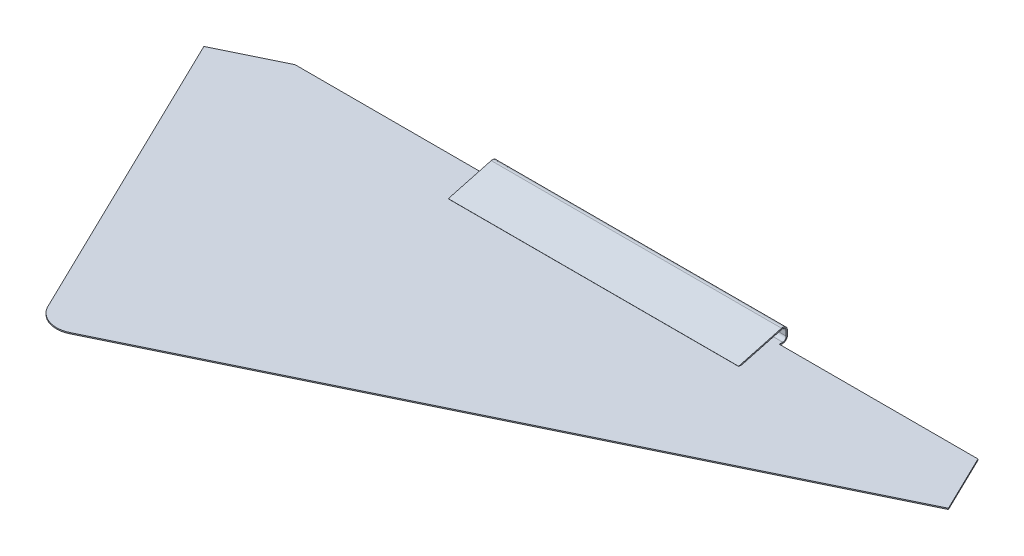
ISO-10303-21;
HEADER;
FILE_DESCRIPTION(('STEP AP214'),'2;1');
FILE_NAME('part.step','',(''),(''),'','','');
FILE_SCHEMA(('AUTOMOTIVE_DESIGN { 1 0 10303 214 1 1 1 1 }'));
ENDSEC;
DATA;
#1=APPLICATION_CONTEXT('core data for automotive mechanical design processes');
#2=APPLICATION_PROTOCOL_DEFINITION('international standard','automotive_design',2000,#1);
#3=PRODUCT_CONTEXT('',#1,'mechanical');
#4=PRODUCT('Part','Part','',(#3));
#5=PRODUCT_RELATED_PRODUCT_CATEGORY('part','',(#4));
#6=PRODUCT_DEFINITION_FORMATION('','',#4);
#7=PRODUCT_DEFINITION_CONTEXT('part definition',#1,'design');
#8=PRODUCT_DEFINITION('design','',#6,#7);
#9=PRODUCT_DEFINITION_SHAPE('','',#8);
#10=(LENGTH_UNIT() NAMED_UNIT(*) SI_UNIT(.MILLI.,.METRE.));
#11=(NAMED_UNIT(*) PLANE_ANGLE_UNIT() SI_UNIT($,.RADIAN.));
#12=(NAMED_UNIT(*) SI_UNIT($,.STERADIAN.) SOLID_ANGLE_UNIT());
#13=UNCERTAINTY_MEASURE_WITH_UNIT(LENGTH_MEASURE(1.E-05),#10,'distance_accuracy_value','');
#14=(GEOMETRIC_REPRESENTATION_CONTEXT(3) GLOBAL_UNCERTAINTY_ASSIGNED_CONTEXT((#13)) GLOBAL_UNIT_ASSIGNED_CONTEXT((#10,
#11,#12)) REPRESENTATION_CONTEXT('',''));
#15=CARTESIAN_POINT('',(0.,0.,0.));
#16=DIRECTION('',(0.,0.,1.));
#17=DIRECTION('',(1.,0.,0.));
#18=AXIS2_PLACEMENT_3D('',#15,#16,#17);
#19=CARTESIAN_POINT('',(296.142830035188,1.,1.11022302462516E-13));
#20=DIRECTION('',(0.,0.,1.));
#21=DIRECTION('',(1.,0.,0.));
#22=AXIS2_PLACEMENT_3D('',#19,#20,#21);
#23=PLANE('',#22);
#24=DIRECTION('',(0.,-1.,0.));
#25=VECTOR('',#24,1.);
#26=CARTESIAN_POINT('',(125.,0.,0.));
#27=LINE('',#26,#25);
#28=CARTESIAN_POINT('',(125.,1.,0.));
#29=VERTEX_POINT('',#28);
#30=CARTESIAN_POINT('',(125.,0.,0.));
#31=VERTEX_POINT('',#30);
#32=EDGE_CURVE('E200',#29,#31,#27,.T.);
#33=ORIENTED_EDGE('',*,*,#32,.F.);
#34=DIRECTION('',(-1.,0.,0.));
#35=VECTOR('',#34,1.);
#36=CARTESIAN_POINT('',(296.142830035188,1.,1.11022302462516E-13));
#37=LINE('',#36,#35);
#38=CARTESIAN_POINT('',(296.142830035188,1.,1.11022302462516E-13));
#39=VERTEX_POINT('',#38);
#40=EDGE_CURVE('E124',#39,#29,#37,.T.);
#41=ORIENTED_EDGE('',*,*,#40,.F.);
#42=DIRECTION('',(0.,-1.,0.));
#43=VECTOR('',#42,1.);
#44=CARTESIAN_POINT('',(296.142830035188,1.,1.11022302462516E-13));
#45=LINE('',#44,#43);
#46=CARTESIAN_POINT('',(296.142830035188,0.,1.11022302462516E-13));
#47=VERTEX_POINT('',#46);
#48=EDGE_CURVE('E55',#39,#47,#45,.T.);
#49=ORIENTED_EDGE('',*,*,#48,.T.);
#50=DIRECTION('',(-1.,0.,0.));
#51=VECTOR('',#50,1.);
#52=CARTESIAN_POINT('',(296.142830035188,0.,1.11022302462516E-13));
#53=LINE('',#52,#51);
#54=EDGE_CURVE('E156',#47,#31,#53,.T.);
#55=ORIENTED_EDGE('',*,*,#54,.T.);
#56=EDGE_LOOP('',(#33,#41,#49,#55));
#57=FACE_BOUND('',#56,.T.);
#58=ADVANCED_FACE('F43',(#57),#23,.F.);
#59=CARTESIAN_POINT('',(-189.016982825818,1.,296.649550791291));
#60=DIRECTION('',(-0.436698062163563,0.,-0.89960813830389));
#61=DIRECTION('',(-0.89960813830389,0.,0.436698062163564));
#62=AXIS2_PLACEMENT_3D('',#59,#60,#61);
#63=PLANE('',#62);
#64=DIRECTION('',(0.89960813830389,0.,-0.436698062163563));
#65=VECTOR('',#64,1.);
#66=CARTESIAN_POINT('',(-189.016982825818,0.,296.649550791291));
#67=LINE('',#66,#65);
#68=CARTESIAN_POINT('',(-189.016982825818,0.,296.649550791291));
#69=VERTEX_POINT('',#68);
#70=CARTESIAN_POINT('',(320.161223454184,0.,49.4784476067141));
#71=VERTEX_POINT('',#70);
#72=EDGE_CURVE('E150',#69,#71,#67,.T.);
#73=ORIENTED_EDGE('',*,*,#72,.T.);
#74=DIRECTION('',(0.,-1.,0.));
#75=VECTOR('',#74,1.);
#76=CARTESIAN_POINT('',(320.161223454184,1.,49.4784476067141));
#77=LINE('',#76,#75);
#78=CARTESIAN_POINT('',(320.161223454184,1.,49.4784476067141));
#79=VERTEX_POINT('',#78);
#80=EDGE_CURVE('E11',#79,#71,#77,.T.);
#81=ORIENTED_EDGE('',*,*,#80,.F.);
#82=DIRECTION('',(0.89960813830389,0.,-0.436698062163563));
#83=VECTOR('',#82,1.);
#84=CARTESIAN_POINT('',(-189.016982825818,1.,296.649550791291));
#85=LINE('',#84,#83);
#86=CARTESIAN_POINT('',(-189.016982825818,1.,296.649550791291));
#87=VERTEX_POINT('',#86);
#88=EDGE_CURVE('E170',#87,#79,#85,.T.);
#89=ORIENTED_EDGE('',*,*,#88,.F.);
#90=DIRECTION('',(0.,-1.,0.));
#91=VECTOR('',#90,1.);
#92=CARTESIAN_POINT('',(-189.016982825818,1.,296.649550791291));
#93=LINE('',#92,#91);
#94=EDGE_CURVE('E141',#87,#69,#93,.T.);
#95=ORIENTED_EDGE('',*,*,#94,.T.);
#96=EDGE_LOOP('',(#73,#81,#89,#95));
#97=FACE_BOUND('',#96,.T.);
#98=ADVANCED_FACE('F44',(#97),#63,.F.);
#99=CARTESIAN_POINT('',(320.161223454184,1.,49.4784476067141));
#100=DIRECTION('',(-0.899608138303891,0.,0.436698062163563));
#101=DIRECTION('',(0.436698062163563,0.,0.899608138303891));
#102=AXIS2_PLACEMENT_3D('',#99,#100,#101);
#103=PLANE('',#102);
#104=DIRECTION('',(-0.436698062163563,0.,-0.899608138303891));
#105=VECTOR('',#104,1.);
#106=CARTESIAN_POINT('',(320.161223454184,0.,49.4784476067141));
#107=LINE('',#106,#105);
#108=EDGE_CURVE('E151',#71,#47,#107,.T.);
#109=ORIENTED_EDGE('',*,*,#108,.T.);
#110=ORIENTED_EDGE('',*,*,#48,.F.);
#111=DIRECTION('',(-0.436698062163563,0.,-0.899608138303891));
#112=VECTOR('',#111,1.);
#113=CARTESIAN_POINT('',(320.161223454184,1.,49.4784476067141));
#114=LINE('',#113,#112);
#115=EDGE_CURVE('E103',#79,#39,#114,.T.);
#116=ORIENTED_EDGE('',*,*,#115,.F.);
#117=ORIENTED_EDGE('',*,*,#80,.T.);
#118=EDGE_LOOP('',(#109,#110,#116,#117));
#119=FACE_BOUND('',#118,.T.);
#120=ADVANCED_FACE('F427',(#119),#103,.F.);
#121=CARTESIAN_POINT('',(-125.,1.,0.));
#122=VERTEX_POINT('',#121);
#123=CARTESIAN_POINT('',(-291.963741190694,1.,0.));
#124=VERTEX_POINT('',#123);
#125=EDGE_CURVE('E117',#122,#124,#37,.T.);
#126=ORIENTED_EDGE('',*,*,#125,.F.);
#127=DIRECTION('',(0.,-1.,0.));
#128=VECTOR('',#127,1.);
#129=CARTESIAN_POINT('',(-125.,0.,0.));
#130=LINE('',#129,#128);
#131=CARTESIAN_POINT('',(-125.,0.,0.));
#132=VERTEX_POINT('',#131);
#133=EDGE_CURVE('E256',#122,#132,#130,.T.);
#134=ORIENTED_EDGE('',*,*,#133,.T.);
#135=CARTESIAN_POINT('',(-291.963741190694,0.,0.));
#136=VERTEX_POINT('',#135);
#137=EDGE_CURVE('E154',#132,#136,#53,.T.);
#138=ORIENTED_EDGE('',*,*,#137,.T.);
#139=DIRECTION('',(0.,-1.,0.));
#140=VECTOR('',#139,1.);
#141=CARTESIAN_POINT('',(-291.963741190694,1.,0.));
#142=LINE('',#141,#140);
#143=EDGE_CURVE('E132',#124,#136,#142,.T.);
#144=ORIENTED_EDGE('',*,*,#143,.F.);
#145=EDGE_LOOP('',(#126,#134,#138,#144));
#146=FACE_BOUND('',#145,.T.);
#147=ADVANCED_FACE('F424',(#146),#23,.F.);
#148=CARTESIAN_POINT('',(-291.963741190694,1.,0.));
#149=DIRECTION('',(0.436698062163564,0.,0.89960813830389));
#150=DIRECTION('',(0.89960813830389,0.,-0.436698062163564));
#151=AXIS2_PLACEMENT_3D('',#148,#149,#150);
#152=PLANE('',#151);
#153=DIRECTION('',(-0.89960813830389,0.,0.436698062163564));
#154=VECTOR('',#153,1.);
#155=CARTESIAN_POINT('',(-291.963741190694,0.,0.));
#156=LINE('',#155,#154);
#157=CARTESIAN_POINT('',(-344.824303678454,0.,25.6601782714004));
#158=VERTEX_POINT('',#157);
#159=EDGE_CURVE('E134',#136,#158,#156,.T.);
#160=ORIENTED_EDGE('',*,*,#159,.T.);
#161=DIRECTION('',(0.,-1.,0.));
#162=VECTOR('',#161,1.);
#163=CARTESIAN_POINT('',(-344.824303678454,1.,25.6601782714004));
#164=LINE('',#163,#162);
#165=CARTESIAN_POINT('',(-344.824303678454,1.,25.6601782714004));
#166=VERTEX_POINT('',#165);
#167=EDGE_CURVE('E126',#166,#158,#164,.T.);
#168=ORIENTED_EDGE('',*,*,#167,.F.);
#169=DIRECTION('',(-0.89960813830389,0.,0.436698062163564));
#170=VECTOR('',#169,1.);
#171=CARTESIAN_POINT('',(-291.963741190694,1.,0.));
#172=LINE('',#171,#170);
#173=EDGE_CURVE('E115',#124,#166,#172,.T.);
#174=ORIENTED_EDGE('',*,*,#173,.F.);
#175=ORIENTED_EDGE('',*,*,#143,.T.);
#176=EDGE_LOOP('',(#160,#168,#174,#175));
#177=FACE_BOUND('',#176,.T.);
#178=ADVANCED_FACE('F129',(#177),#152,.F.);
#179=CARTESIAN_POINT('',(-344.824303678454,1.,25.6601782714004));
#180=DIRECTION('',(0.89960813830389,0.,-0.436698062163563));
#181=DIRECTION('',(-0.436698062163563,0.,-0.89960813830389));
#182=AXIS2_PLACEMENT_3D('',#179,#180,#181);
#183=PLANE('',#182);
#184=DIRECTION('',(0.436698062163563,0.,0.89960813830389));
#185=VECTOR('',#184,1.);
#186=CARTESIAN_POINT('',(-344.824303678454,0.,25.6601782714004));
#187=LINE('',#186,#185);
#188=CARTESIAN_POINT('',(-218.18186565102,0.,286.546538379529));
#189=VERTEX_POINT('',#188);
#190=EDGE_CURVE('E165',#158,#189,#187,.T.);
#191=ORIENTED_EDGE('',*,*,#190,.T.);
#192=DIRECTION('',(0.,-1.,0.));
#193=VECTOR('',#192,1.);
#194=CARTESIAN_POINT('',(-218.18186565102,1.,286.546538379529));
#195=LINE('',#194,#193);
#196=CARTESIAN_POINT('',(-218.18186565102,1.,286.546538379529));
#197=VERTEX_POINT('',#196);
#198=EDGE_CURVE('E136',#197,#189,#195,.T.);
#199=ORIENTED_EDGE('',*,*,#198,.F.);
#200=DIRECTION('',(0.436698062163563,0.,0.89960813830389));
#201=VECTOR('',#200,1.);
#202=CARTESIAN_POINT('',(-344.824303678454,1.,25.6601782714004));
#203=LINE('',#202,#201);
#204=EDGE_CURVE('E119',#166,#197,#203,.T.);
#205=ORIENTED_EDGE('',*,*,#204,.F.);
#206=ORIENTED_EDGE('',*,*,#167,.T.);
#207=EDGE_LOOP('',(#191,#199,#205,#206));
#208=FACE_BOUND('',#207,.T.);
#209=ADVANCED_FACE('F138',(#208),#183,.F.);
#210=CARTESIAN_POINT('',(-198.547918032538,1.,277.015603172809));
#211=DIRECTION('',(0.,-1.,0.));
#212=DIRECTION('',(0.,0.,-1.));
#213=AXIS2_PLACEMENT_3D('',#210,#211,#212);
#214=CYLINDRICAL_SURFACE('',#213,21.825);
#215=CARTESIAN_POINT('',(-198.547918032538,0.,277.015603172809));
#216=DIRECTION('',(0.,1.,0.));
#217=DIRECTION('',(0.,0.,-1.));
#218=AXIS2_PLACEMENT_3D('',#215,#216,#217);
#219=CIRCLE('',#218,21.825);
#220=EDGE_CURVE('E92',#189,#69,#219,.T.);
#221=ORIENTED_EDGE('',*,*,#220,.T.);
#222=ORIENTED_EDGE('',*,*,#94,.F.);
#223=CARTESIAN_POINT('',(-198.547918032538,1.,277.015603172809));
#224=DIRECTION('',(0.,1.,0.));
#225=DIRECTION('',(0.,0.,-1.));
#226=AXIS2_PLACEMENT_3D('',#223,#224,#225);
#227=CIRCLE('',#226,21.825);
#228=EDGE_CURVE('E68',#197,#87,#227,.T.);
#229=ORIENTED_EDGE('',*,*,#228,.F.);
#230=ORIENTED_EDGE('',*,*,#198,.T.);
#231=EDGE_LOOP('',(#221,#222,#229,#230));
#232=FACE_BOUND('',#231,.T.);
#233=ADVANCED_FACE('F422',(#232),#214,.T.);
#234=CARTESIAN_POINT('',(-198.547918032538,1.,277.015603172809));
#235=DIRECTION('',(0.,-1.,0.));
#236=DIRECTION('',(0.,0.,-1.));
#237=AXIS2_PLACEMENT_3D('',#234,#235,#236);
#238=PLANE('',#237);
#239=ORIENTED_EDGE('',*,*,#88,.T.);
#240=ORIENTED_EDGE('',*,*,#115,.T.);
#241=ORIENTED_EDGE('',*,*,#40,.T.);
#242=DIRECTION('',(0.,0.,1.));
#243=VECTOR('',#242,1.);
#244=CARTESIAN_POINT('',(125.,1.,0.));
#245=LINE('',#244,#243);
#246=CARTESIAN_POINT('',(125.,1.,-2.99999999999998));
#247=VERTEX_POINT('',#246);
#248=EDGE_CURVE('E206',#247,#29,#245,.T.);
#249=ORIENTED_EDGE('',*,*,#248,.F.);
#250=DIRECTION('',(1.,0.,0.));
#251=VECTOR('',#250,1.);
#252=CARTESIAN_POINT('',(-125.,1.,-2.99999999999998));
#253=LINE('',#252,#251);
#254=CARTESIAN_POINT('',(-125.,1.,-2.99999999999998));
#255=VERTEX_POINT('',#254);
#256=EDGE_CURVE('E155',#255,#247,#253,.T.);
#257=ORIENTED_EDGE('',*,*,#256,.F.);
#258=DIRECTION('',(0.,0.,1.));
#259=VECTOR('',#258,1.);
#260=CARTESIAN_POINT('',(-125.,1.,0.));
#261=LINE('',#260,#259);
#262=EDGE_CURVE('E313',#255,#122,#261,.T.);
#263=ORIENTED_EDGE('',*,*,#262,.T.);
#264=ORIENTED_EDGE('',*,*,#125,.T.);
#265=ORIENTED_EDGE('',*,*,#173,.T.);
#266=ORIENTED_EDGE('',*,*,#204,.T.);
#267=ORIENTED_EDGE('',*,*,#228,.T.);
#268=EDGE_LOOP('',(#239,#240,#241,#249,#257,#263,#264,#265,#266,#267));
#269=FACE_BOUND('',#268,.T.);
#270=ADVANCED_FACE('F111',(#269),#238,.F.);
#271=CARTESIAN_POINT('',(-198.547918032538,0.,277.015603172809));
#272=DIRECTION('',(0.,-1.,0.));
#273=DIRECTION('',(0.,0.,-1.));
#274=AXIS2_PLACEMENT_3D('',#271,#272,#273);
#275=PLANE('',#274);
#276=ORIENTED_EDGE('',*,*,#72,.F.);
#277=ORIENTED_EDGE('',*,*,#220,.F.);
#278=ORIENTED_EDGE('',*,*,#190,.F.);
#279=ORIENTED_EDGE('',*,*,#159,.F.);
#280=ORIENTED_EDGE('',*,*,#137,.F.);
#281=DIRECTION('',(0.,0.,-1.));
#282=VECTOR('',#281,1.);
#283=CARTESIAN_POINT('',(-125.,0.,0.));
#284=LINE('',#283,#282);
#285=CARTESIAN_POINT('',(-125.,0.,-3.));
#286=VERTEX_POINT('',#285);
#287=EDGE_CURVE('E56',#132,#286,#284,.T.);
#288=ORIENTED_EDGE('',*,*,#287,.T.);
#289=DIRECTION('',(1.,0.,0.));
#290=VECTOR('',#289,1.);
#291=CARTESIAN_POINT('',(-125.,0.,-3.));
#292=LINE('',#291,#290);
#293=CARTESIAN_POINT('',(125.,0.,-3.00000000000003));
#294=VERTEX_POINT('',#293);
#295=EDGE_CURVE('E195',#286,#294,#292,.T.);
#296=ORIENTED_EDGE('',*,*,#295,.T.);
#297=DIRECTION('',(0.,0.,-1.));
#298=VECTOR('',#297,1.);
#299=CARTESIAN_POINT('',(125.,0.,0.));
#300=LINE('',#299,#298);
#301=EDGE_CURVE('E190',#31,#294,#300,.T.);
#302=ORIENTED_EDGE('',*,*,#301,.F.);
#303=ORIENTED_EDGE('',*,*,#54,.F.);
#304=ORIENTED_EDGE('',*,*,#108,.F.);
#305=EDGE_LOOP('',(#276,#277,#278,#279,#280,#288,#296,#302,#303,#304));
#306=FACE_BOUND('',#305,.T.);
#307=ADVANCED_FACE('F183',(#306),#275,.T.);
#308=CARTESIAN_POINT('',(-125.,4.,-3.));
#309=DIRECTION('',(1.,0.,0.));
#310=DIRECTION('',(0.,0.,-1.));
#311=AXIS2_PLACEMENT_3D('',#308,#309,#310);
#312=CYLINDRICAL_SURFACE('',#311,3.);
#313=ORIENTED_EDGE('',*,*,#256,.T.);
#314=CARTESIAN_POINT('',(125.,4.,-3.00000000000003));
#315=DIRECTION('',(-1.,0.,0.));
#316=DIRECTION('',(0.,0.,-1.));
#317=AXIS2_PLACEMENT_3D('',#314,#315,#316);
#318=CIRCLE('',#317,3.);
#319=CARTESIAN_POINT('',(125.,4.,-6.00000000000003));
#320=VERTEX_POINT('',#319);
#321=EDGE_CURVE('E251',#320,#247,#318,.T.);
#322=ORIENTED_EDGE('',*,*,#321,.F.);
#323=DIRECTION('',(1.,0.,0.));
#324=VECTOR('',#323,1.);
#325=CARTESIAN_POINT('',(-125.,4.,-5.99999999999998));
#326=LINE('',#325,#324);
#327=CARTESIAN_POINT('',(-125.,4.,-5.99999999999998));
#328=VERTEX_POINT('',#327);
#329=EDGE_CURVE('E320',#328,#320,#326,.T.);
#330=ORIENTED_EDGE('',*,*,#329,.F.);
#331=CARTESIAN_POINT('',(-125.,4.,-3.));
#332=DIRECTION('',(-1.,0.,0.));
#333=DIRECTION('',(0.,0.,-1.));
#334=AXIS2_PLACEMENT_3D('',#331,#332,#333);
#335=CIRCLE('',#334,3.);
#336=EDGE_CURVE('E307',#328,#255,#335,.T.);
#337=ORIENTED_EDGE('',*,*,#336,.T.);
#338=EDGE_LOOP('',(#313,#322,#330,#337));
#339=FACE_BOUND('',#338,.T.);
#340=ADVANCED_FACE('F455',(#339),#312,.F.);
#341=CARTESIAN_POINT('',(-125.,4.,-5.99999999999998));
#342=DIRECTION('',(0.,0.,1.));
#343=DIRECTION('',(0.,-1.,0.));
#344=AXIS2_PLACEMENT_3D('',#341,#342,#343);
#345=PLANE('',#344);
#346=ORIENTED_EDGE('',*,*,#329,.T.);
#347=DIRECTION('',(0.,-1.,0.));
#348=VECTOR('',#347,1.);
#349=CARTESIAN_POINT('',(125.,4.,-6.00000000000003));
#350=LINE('',#349,#348);
#351=CARTESIAN_POINT('',(125.,8.08244604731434,-6.00000000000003));
#352=VERTEX_POINT('',#351);
#353=EDGE_CURVE('E247',#352,#320,#350,.T.);
#354=ORIENTED_EDGE('',*,*,#353,.F.);
#355=DIRECTION('',(1.,0.,0.));
#356=VECTOR('',#355,1.);
#357=CARTESIAN_POINT('',(-125.,8.08244604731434,-5.99999999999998));
#358=LINE('',#357,#356);
#359=CARTESIAN_POINT('',(-125.,8.08244604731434,-5.99999999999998));
#360=VERTEX_POINT('',#359);
#361=EDGE_CURVE('E321',#360,#352,#358,.T.);
#362=ORIENTED_EDGE('',*,*,#361,.F.);
#363=DIRECTION('',(0.,-1.,0.));
#364=VECTOR('',#363,1.);
#365=CARTESIAN_POINT('',(-125.,4.,-5.99999999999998));
#366=LINE('',#365,#364);
#367=EDGE_CURVE('E303',#360,#328,#366,.T.);
#368=ORIENTED_EDGE('',*,*,#367,.T.);
#369=EDGE_LOOP('',(#346,#354,#362,#368));
#370=FACE_BOUND('',#369,.T.);
#371=ADVANCED_FACE('F493',(#370),#345,.T.);
#372=CARTESIAN_POINT('',(-125.,8.08244604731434,-2.99999999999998));
#373=DIRECTION('',(1.,0.,0.));
#374=DIRECTION('',(0.,0.,-1.));
#375=AXIS2_PLACEMENT_3D('',#372,#373,#374);
#376=CYLINDRICAL_SURFACE('',#375,3.);
#377=ORIENTED_EDGE('',*,*,#361,.T.);
#378=CARTESIAN_POINT('',(125.,8.08244604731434,-2.99999999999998));
#379=DIRECTION('',(-1.,0.,0.));
#380=DIRECTION('',(0.,0.,-1.));
#381=AXIS2_PLACEMENT_3D('',#378,#379,#380);
#382=CIRCLE('',#381,3.);
#383=CARTESIAN_POINT('',(125.,10.9802235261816,-2.22354286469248));
#384=VERTEX_POINT('',#383);
#385=EDGE_CURVE('E242',#384,#352,#382,.T.);
#386=ORIENTED_EDGE('',*,*,#385,.F.);
#387=DIRECTION('',(1.,0.,0.));
#388=VECTOR('',#387,1.);
#389=CARTESIAN_POINT('',(-125.,10.9802235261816,-2.22354286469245));
#390=LINE('',#389,#388);
#391=CARTESIAN_POINT('',(-125.,10.9802235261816,-2.22354286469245));
#392=VERTEX_POINT('',#391);
#393=EDGE_CURVE('E324',#392,#384,#390,.T.);
#394=ORIENTED_EDGE('',*,*,#393,.F.);
#395=CARTESIAN_POINT('',(-125.,8.08244604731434,-2.99999999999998));
#396=DIRECTION('',(-1.,0.,0.));
#397=DIRECTION('',(0.,0.,-1.));
#398=AXIS2_PLACEMENT_3D('',#395,#396,#397);
#399=CIRCLE('',#398,3.);
#400=EDGE_CURVE('E298',#392,#360,#399,.T.);
#401=ORIENTED_EDGE('',*,*,#400,.T.);
#402=EDGE_LOOP('',(#377,#386,#394,#401));
#403=FACE_BOUND('',#402,.T.);
#404=ADVANCED_FACE('F489',(#403),#376,.F.);
#405=CARTESIAN_POINT('',(-125.,10.9802235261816,-2.22354286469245));
#406=DIRECTION('',(0.,-0.96592582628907,-0.258819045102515));
#407=DIRECTION('',(0.,0.258819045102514,-0.965925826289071));
#408=AXIS2_PLACEMENT_3D('',#405,#406,#407);
#409=PLANE('',#408);
#410=ORIENTED_EDGE('',*,*,#393,.T.);
#411=DIRECTION('',(0.,0.258819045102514,-0.965925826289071));
#412=VECTOR('',#411,1.);
#413=CARTESIAN_POINT('',(125.,10.9802235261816,-2.22354286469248));
#414=LINE('',#413,#412);
#415=CARTESIAN_POINT('',(125.,1.80851854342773,32.0057261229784));
#416=VERTEX_POINT('',#415);
#417=EDGE_CURVE('E244',#416,#384,#414,.T.);
#418=ORIENTED_EDGE('',*,*,#417,.F.);
#419=DIRECTION('',(1.,0.,0.));
#420=VECTOR('',#419,1.);
#421=CARTESIAN_POINT('',(-125.,1.80851854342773,32.0057261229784));
#422=LINE('',#421,#420);
#423=CARTESIAN_POINT('',(-125.,1.80851854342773,32.0057261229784));
#424=VERTEX_POINT('',#423);
#425=EDGE_CURVE('E328',#424,#416,#422,.T.);
#426=ORIENTED_EDGE('',*,*,#425,.F.);
#427=DIRECTION('',(0.,0.258819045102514,-0.965925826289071));
#428=VECTOR('',#427,1.);
#429=CARTESIAN_POINT('',(-125.,10.9802235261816,-2.22354286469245));
#430=LINE('',#429,#428);
#431=EDGE_CURVE('E293',#424,#392,#430,.T.);
#432=ORIENTED_EDGE('',*,*,#431,.T.);
#433=EDGE_LOOP('',(#410,#418,#426,#432));
#434=FACE_BOUND('',#433,.T.);
#435=ADVANCED_FACE('F486',(#434),#409,.T.);
#436=CARTESIAN_POINT('',(-125.,2.05,32.070430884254));
#437=DIRECTION('',(1.,0.,0.));
#438=DIRECTION('',(0.,0.,-1.));
#439=AXIS2_PLACEMENT_3D('',#436,#437,#438);
#440=CYLINDRICAL_SURFACE('',#439,0.250000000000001);
#441=ORIENTED_EDGE('',*,*,#425,.T.);
#442=CARTESIAN_POINT('',(125.,2.05,32.070430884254));
#443=DIRECTION('',(1.,0.,0.));
#444=DIRECTION('',(0.,0.,1.));
#445=AXIS2_PLACEMENT_3D('',#442,#443,#444);
#446=CIRCLE('',#445,0.250000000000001);
#447=CARTESIAN_POINT('',(125.,1.8,32.070430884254));
#448=VERTEX_POINT('',#447);
#449=EDGE_CURVE('E240',#448,#416,#446,.T.);
#450=ORIENTED_EDGE('',*,*,#449,.F.);
#451=DIRECTION('',(1.,0.,0.));
#452=VECTOR('',#451,1.);
#453=CARTESIAN_POINT('',(-125.,1.8,32.070430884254));
#454=LINE('',#453,#452);
#455=CARTESIAN_POINT('',(-125.,1.8,32.070430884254));
#456=VERTEX_POINT('',#455);
#457=EDGE_CURVE('E334',#456,#448,#454,.T.);
#458=ORIENTED_EDGE('',*,*,#457,.F.);
#459=CARTESIAN_POINT('',(-125.,2.05,32.070430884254));
#460=DIRECTION('',(1.,0.,0.));
#461=DIRECTION('',(0.,0.,1.));
#462=AXIS2_PLACEMENT_3D('',#459,#460,#461);
#463=CIRCLE('',#462,0.250000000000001);
#464=EDGE_CURVE('E292',#456,#424,#463,.T.);
#465=ORIENTED_EDGE('',*,*,#464,.T.);
#466=EDGE_LOOP('',(#441,#450,#458,#465));
#467=FACE_BOUND('',#466,.T.);
#468=ADVANCED_FACE('F485',(#467),#440,.T.);
#469=CARTESIAN_POINT('',(-125.,1.8,34.7434634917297));
#470=DIRECTION('',(0.,-1.,0.));
#471=DIRECTION('',(0.,0.,-1.));
#472=AXIS2_PLACEMENT_3D('',#469,#470,#471);
#473=PLANE('',#472);
#474=ORIENTED_EDGE('',*,*,#457,.T.);
#475=DIRECTION('',(0.,0.,-1.));
#476=VECTOR('',#475,1.);
#477=CARTESIAN_POINT('',(125.,1.8,34.7434634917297));
#478=LINE('',#477,#476);
#479=CARTESIAN_POINT('',(125.,1.8,34.7434634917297));
#480=VERTEX_POINT('',#479);
#481=EDGE_CURVE('E233',#480,#448,#478,.T.);
#482=ORIENTED_EDGE('',*,*,#481,.F.);
#483=DIRECTION('',(1.,0.,0.));
#484=VECTOR('',#483,1.);
#485=CARTESIAN_POINT('',(-125.,1.8,34.7434634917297));
#486=LINE('',#485,#484);
#487=CARTESIAN_POINT('',(-125.,1.8,34.7434634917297));
#488=VERTEX_POINT('',#487);
#489=EDGE_CURVE('E336',#488,#480,#486,.T.);
#490=ORIENTED_EDGE('',*,*,#489,.F.);
#491=DIRECTION('',(0.,0.,-1.));
#492=VECTOR('',#491,1.);
#493=CARTESIAN_POINT('',(-125.,1.8,34.7434634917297));
#494=LINE('',#493,#492);
#495=EDGE_CURVE('E290',#488,#456,#494,.T.);
#496=ORIENTED_EDGE('',*,*,#495,.T.);
#497=EDGE_LOOP('',(#474,#482,#490,#496));
#498=FACE_BOUND('',#497,.T.);
#499=ADVANCED_FACE('F476',(#498),#473,.T.);
#500=CARTESIAN_POINT('',(-125.,2.05,34.7434634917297));
#501=DIRECTION('',(1.,0.,0.));
#502=DIRECTION('',(0.,0.,-1.));
#503=AXIS2_PLACEMENT_3D('',#500,#501,#502);
#504=CYLINDRICAL_SURFACE('',#503,0.25);
#505=ORIENTED_EDGE('',*,*,#489,.T.);
#506=CARTESIAN_POINT('',(125.,2.05,34.7434634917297));
#507=DIRECTION('',(1.,0.,0.));
#508=DIRECTION('',(0.,0.,1.));
#509=AXIS2_PLACEMENT_3D('',#506,#507,#508);
#510=CIRCLE('',#509,0.25);
#511=CARTESIAN_POINT('',(125.,1.98529523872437,34.9849449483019));
#512=VERTEX_POINT('',#511);
#513=EDGE_CURVE('E228',#512,#480,#510,.T.);
#514=ORIENTED_EDGE('',*,*,#513,.F.);
#515=DIRECTION('',(1.,0.,0.));
#516=VECTOR('',#515,1.);
#517=CARTESIAN_POINT('',(-125.,1.98529523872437,34.984944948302));
#518=LINE('',#517,#516);
#519=CARTESIAN_POINT('',(-125.,1.98529523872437,34.984944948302));
#520=VERTEX_POINT('',#519);
#521=EDGE_CURVE('E341',#520,#512,#518,.T.);
#522=ORIENTED_EDGE('',*,*,#521,.F.);
#523=CARTESIAN_POINT('',(-125.,2.05,34.7434634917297));
#524=DIRECTION('',(1.,0.,0.));
#525=DIRECTION('',(0.,0.,1.));
#526=AXIS2_PLACEMENT_3D('',#523,#524,#525);
#527=CIRCLE('',#526,0.25);
#528=EDGE_CURVE('E285',#520,#488,#527,.T.);
#529=ORIENTED_EDGE('',*,*,#528,.T.);
#530=EDGE_LOOP('',(#505,#514,#522,#529));
#531=FACE_BOUND('',#530,.T.);
#532=ADVANCED_FACE('F475',(#531),#504,.T.);
#533=CARTESIAN_POINT('',(-125.,2.04148145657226,35.0000000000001));
#534=DIRECTION('',(0.,-0.258819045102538,0.965925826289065));
#535=DIRECTION('',(0.,-0.965925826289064,-0.258819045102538));
#536=AXIS2_PLACEMENT_3D('',#533,#534,#535);
#537=PLANE('',#536);
#538=ORIENTED_EDGE('',*,*,#521,.T.);
#539=DIRECTION('',(0.,-0.965925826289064,-0.258819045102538));
#540=VECTOR('',#539,1.);
#541=CARTESIAN_POINT('',(125.,2.04148145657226,35.));
#542=LINE('',#541,#540);
#543=CARTESIAN_POINT('',(125.,2.04148145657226,35.));
#544=VERTEX_POINT('',#543);
#545=EDGE_CURVE('E223',#544,#512,#542,.T.);
#546=ORIENTED_EDGE('',*,*,#545,.F.);
#547=DIRECTION('',(1.,0.,0.));
#548=VECTOR('',#547,1.);
#549=CARTESIAN_POINT('',(-125.,2.04148145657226,35.0000000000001));
#550=LINE('',#549,#548);
#551=CARTESIAN_POINT('',(-125.,2.04148145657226,35.0000000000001));
#552=VERTEX_POINT('',#551);
#553=EDGE_CURVE('E344',#552,#544,#550,.T.);
#554=ORIENTED_EDGE('',*,*,#553,.F.);
#555=DIRECTION('',(0.,-0.965925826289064,-0.258819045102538));
#556=VECTOR('',#555,1.);
#557=CARTESIAN_POINT('',(-125.,2.04148145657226,35.0000000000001));
#558=LINE('',#557,#556);
#559=EDGE_CURVE('E276',#552,#520,#558,.T.);
#560=ORIENTED_EDGE('',*,*,#559,.T.);
#561=EDGE_LOOP('',(#538,#546,#554,#560));
#562=FACE_BOUND('',#561,.T.);
#563=ADVANCED_FACE('F469',(#562),#537,.T.);
#564=CARTESIAN_POINT('',(-125.,11.9461493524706,-1.96472381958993));
#565=DIRECTION('',(0.,0.96592582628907,0.258819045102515));
#566=DIRECTION('',(0.,-0.258819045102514,0.965925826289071));
#567=AXIS2_PLACEMENT_3D('',#564,#565,#566);
#568=PLANE('',#567);
#569=ORIENTED_EDGE('',*,*,#553,.T.);
#570=DIRECTION('',(0.,-0.258819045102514,0.965925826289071));
#571=VECTOR('',#570,1.);
#572=CARTESIAN_POINT('',(125.,11.9461493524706,-1.96472381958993));
#573=LINE('',#572,#571);
#574=CARTESIAN_POINT('',(125.,11.9461493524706,-1.96472381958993));
#575=VERTEX_POINT('',#574);
#576=EDGE_CURVE('E222',#575,#544,#573,.T.);
#577=ORIENTED_EDGE('',*,*,#576,.F.);
#578=DIRECTION('',(1.,0.,0.));
#579=VECTOR('',#578,1.);
#580=CARTESIAN_POINT('',(-125.,11.9461493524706,-1.96472381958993));
#581=LINE('',#580,#579);
#582=CARTESIAN_POINT('',(-125.,11.9461493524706,-1.96472381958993));
#583=VERTEX_POINT('',#582);
#584=EDGE_CURVE('E349',#583,#575,#581,.T.);
#585=ORIENTED_EDGE('',*,*,#584,.F.);
#586=DIRECTION('',(0.,-0.258819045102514,0.965925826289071));
#587=VECTOR('',#586,1.);
#588=CARTESIAN_POINT('',(-125.,11.9461493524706,-1.96472381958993));
#589=LINE('',#588,#587);
#590=EDGE_CURVE('E274',#583,#552,#589,.T.);
#591=ORIENTED_EDGE('',*,*,#590,.T.);
#592=EDGE_LOOP('',(#569,#577,#585,#591));
#593=FACE_BOUND('',#592,.T.);
#594=ADVANCED_FACE('F466',(#593),#568,.T.);
#595=CARTESIAN_POINT('',(-125.,8.08244604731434,-2.99999999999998));
#596=DIRECTION('',(1.,0.,0.));
#597=DIRECTION('',(0.,0.,-1.));
#598=AXIS2_PLACEMENT_3D('',#595,#596,#597);
#599=CYLINDRICAL_SURFACE('',#598,4.);
#600=ORIENTED_EDGE('',*,*,#584,.T.);
#601=CARTESIAN_POINT('',(125.,8.08244604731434,-2.99999999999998));
#602=DIRECTION('',(1.,0.,0.));
#603=DIRECTION('',(0.,0.,-1.));
#604=AXIS2_PLACEMENT_3D('',#601,#602,#603);
#605=CIRCLE('',#604,4.);
#606=CARTESIAN_POINT('',(125.,8.08244604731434,-6.99999999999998));
#607=VERTEX_POINT('',#606);
#608=EDGE_CURVE('E220',#607,#575,#605,.T.);
#609=ORIENTED_EDGE('',*,*,#608,.F.);
#610=DIRECTION('',(1.,0.,0.));
#611=VECTOR('',#610,1.);
#612=CARTESIAN_POINT('',(-125.,8.08244604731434,-6.9999999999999));
#613=LINE('',#612,#611);
#614=CARTESIAN_POINT('',(-125.,8.08244604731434,-6.9999999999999));
#615=VERTEX_POINT('',#614);
#616=EDGE_CURVE('E355',#615,#607,#613,.T.);
#617=ORIENTED_EDGE('',*,*,#616,.F.);
#618=CARTESIAN_POINT('',(-125.,8.08244604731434,-2.99999999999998));
#619=DIRECTION('',(1.,0.,0.));
#620=DIRECTION('',(0.,0.,-1.));
#621=AXIS2_PLACEMENT_3D('',#618,#619,#620);
#622=CIRCLE('',#621,4.);
#623=EDGE_CURVE('E271',#615,#583,#622,.T.);
#624=ORIENTED_EDGE('',*,*,#623,.T.);
#625=EDGE_LOOP('',(#600,#609,#617,#624));
#626=FACE_BOUND('',#625,.T.);
#627=ADVANCED_FACE('F461',(#626),#599,.T.);
#628=CARTESIAN_POINT('',(-125.,4.,-6.9999999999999));
#629=DIRECTION('',(0.,0.,-1.));
#630=DIRECTION('',(0.,1.,0.));
#631=AXIS2_PLACEMENT_3D('',#628,#629,#630);
#632=PLANE('',#631);
#633=ORIENTED_EDGE('',*,*,#616,.T.);
#634=DIRECTION('',(0.,1.,0.));
#635=VECTOR('',#634,1.);
#636=CARTESIAN_POINT('',(125.,4.,-6.99999999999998));
#637=LINE('',#636,#635);
#638=CARTESIAN_POINT('',(125.,4.,-6.99999999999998));
#639=VERTEX_POINT('',#638);
#640=EDGE_CURVE('E213',#639,#607,#637,.T.);
#641=ORIENTED_EDGE('',*,*,#640,.F.);
#642=DIRECTION('',(1.,0.,0.));
#643=VECTOR('',#642,1.);
#644=CARTESIAN_POINT('',(-125.,4.,-6.9999999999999));
#645=LINE('',#644,#643);
#646=CARTESIAN_POINT('',(-125.,4.,-6.9999999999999));
#647=VERTEX_POINT('',#646);
#648=EDGE_CURVE('E360',#647,#639,#645,.T.);
#649=ORIENTED_EDGE('',*,*,#648,.F.);
#650=DIRECTION('',(0.,1.,0.));
#651=VECTOR('',#650,1.);
#652=CARTESIAN_POINT('',(-125.,4.,-6.9999999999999));
#653=LINE('',#652,#651);
#654=EDGE_CURVE('E270',#647,#615,#653,.T.);
#655=ORIENTED_EDGE('',*,*,#654,.T.);
#656=EDGE_LOOP('',(#633,#641,#649,#655));
#657=FACE_BOUND('',#656,.T.);
#658=ADVANCED_FACE('F456',(#657),#632,.T.);
#659=CARTESIAN_POINT('',(-125.,4.,-3.));
#660=DIRECTION('',(1.,0.,0.));
#661=DIRECTION('',(0.,0.,-1.));
#662=AXIS2_PLACEMENT_3D('',#659,#660,#661);
#663=CYLINDRICAL_SURFACE('',#662,4.);
#664=ORIENTED_EDGE('',*,*,#648,.T.);
#665=CARTESIAN_POINT('',(125.,4.,-3.00000000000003));
#666=DIRECTION('',(1.,0.,0.));
#667=DIRECTION('',(0.,0.,-1.));
#668=AXIS2_PLACEMENT_3D('',#665,#666,#667);
#669=CIRCLE('',#668,4.);
#670=EDGE_CURVE('E196',#294,#639,#669,.T.);
#671=ORIENTED_EDGE('',*,*,#670,.F.);
#672=ORIENTED_EDGE('',*,*,#295,.F.);
#673=CARTESIAN_POINT('',(-125.,4.,-3.));
#674=DIRECTION('',(1.,0.,0.));
#675=DIRECTION('',(0.,0.,-1.));
#676=AXIS2_PLACEMENT_3D('',#673,#674,#675);
#677=CIRCLE('',#676,4.);
#678=EDGE_CURVE('E263',#286,#647,#677,.T.);
#679=ORIENTED_EDGE('',*,*,#678,.T.);
#680=EDGE_LOOP('',(#664,#671,#672,#679));
#681=FACE_BOUND('',#680,.T.);
#682=ADVANCED_FACE('F452',(#681),#663,.T.);
#683=CARTESIAN_POINT('',(-125.,4.,-3.));
#684=DIRECTION('',(1.,0.,0.));
#685=DIRECTION('',(0.,0.,-1.));
#686=AXIS2_PLACEMENT_3D('',#683,#684,#685);
#687=PLANE('',#686);
#688=ORIENTED_EDGE('',*,*,#133,.F.);
#689=ORIENTED_EDGE('',*,*,#262,.F.);
#690=ORIENTED_EDGE('',*,*,#336,.F.);
#691=ORIENTED_EDGE('',*,*,#367,.F.);
#692=ORIENTED_EDGE('',*,*,#400,.F.);
#693=ORIENTED_EDGE('',*,*,#431,.F.);
#694=ORIENTED_EDGE('',*,*,#464,.F.);
#695=ORIENTED_EDGE('',*,*,#495,.F.);
#696=ORIENTED_EDGE('',*,*,#528,.F.);
#697=ORIENTED_EDGE('',*,*,#559,.F.);
#698=ORIENTED_EDGE('',*,*,#590,.F.);
#699=ORIENTED_EDGE('',*,*,#623,.F.);
#700=ORIENTED_EDGE('',*,*,#654,.F.);
#701=ORIENTED_EDGE('',*,*,#678,.F.);
#702=ORIENTED_EDGE('',*,*,#287,.F.);
#703=EDGE_LOOP('',(#688,#689,#690,#691,#692,#693,#694,#695,#696,#697,#698,#699,#700,#701,#702));
#704=FACE_BOUND('',#703,.T.);
#705=ADVANCED_FACE('F460',(#704),#687,.F.);
#706=CARTESIAN_POINT('',(125.,4.,-3.00000000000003));
#707=DIRECTION('',(1.,0.,0.));
#708=DIRECTION('',(0.,0.,-1.));
#709=AXIS2_PLACEMENT_3D('',#706,#707,#708);
#710=PLANE('',#709);
#711=ORIENTED_EDGE('',*,*,#32,.T.);
#712=ORIENTED_EDGE('',*,*,#301,.T.);
#713=ORIENTED_EDGE('',*,*,#670,.T.);
#714=ORIENTED_EDGE('',*,*,#640,.T.);
#715=ORIENTED_EDGE('',*,*,#608,.T.);
#716=ORIENTED_EDGE('',*,*,#576,.T.);
#717=ORIENTED_EDGE('',*,*,#545,.T.);
#718=ORIENTED_EDGE('',*,*,#513,.T.);
#719=ORIENTED_EDGE('',*,*,#481,.T.);
#720=ORIENTED_EDGE('',*,*,#449,.T.);
#721=ORIENTED_EDGE('',*,*,#417,.T.);
#722=ORIENTED_EDGE('',*,*,#385,.T.);
#723=ORIENTED_EDGE('',*,*,#353,.T.);
#724=ORIENTED_EDGE('',*,*,#321,.T.);
#725=ORIENTED_EDGE('',*,*,#248,.T.);
#726=EDGE_LOOP('',(#711,#712,#713,#714,#715,#716,#717,#718,#719,#720,#721,#722,#723,#724,#725));
#727=FACE_BOUND('',#726,.T.);
#728=ADVANCED_FACE('F205',(#727),#710,.T.);
#729=CLOSED_SHELL('',(#58,#98,#120,#147,#178,#209,#233,#270,#307,#340,#371,#404,#435,#468,#499,
#532,#563,#594,#627,#658,#682,#705,#728));
#730=MANIFOLD_SOLID_BREP('B2',#729);
#731=ADVANCED_BREP_SHAPE_REPRESENTATION('',(#18,#730),#14);
#732=SHAPE_DEFINITION_REPRESENTATION(#9,#731);
ENDSEC;
END-ISO-10303-21;
